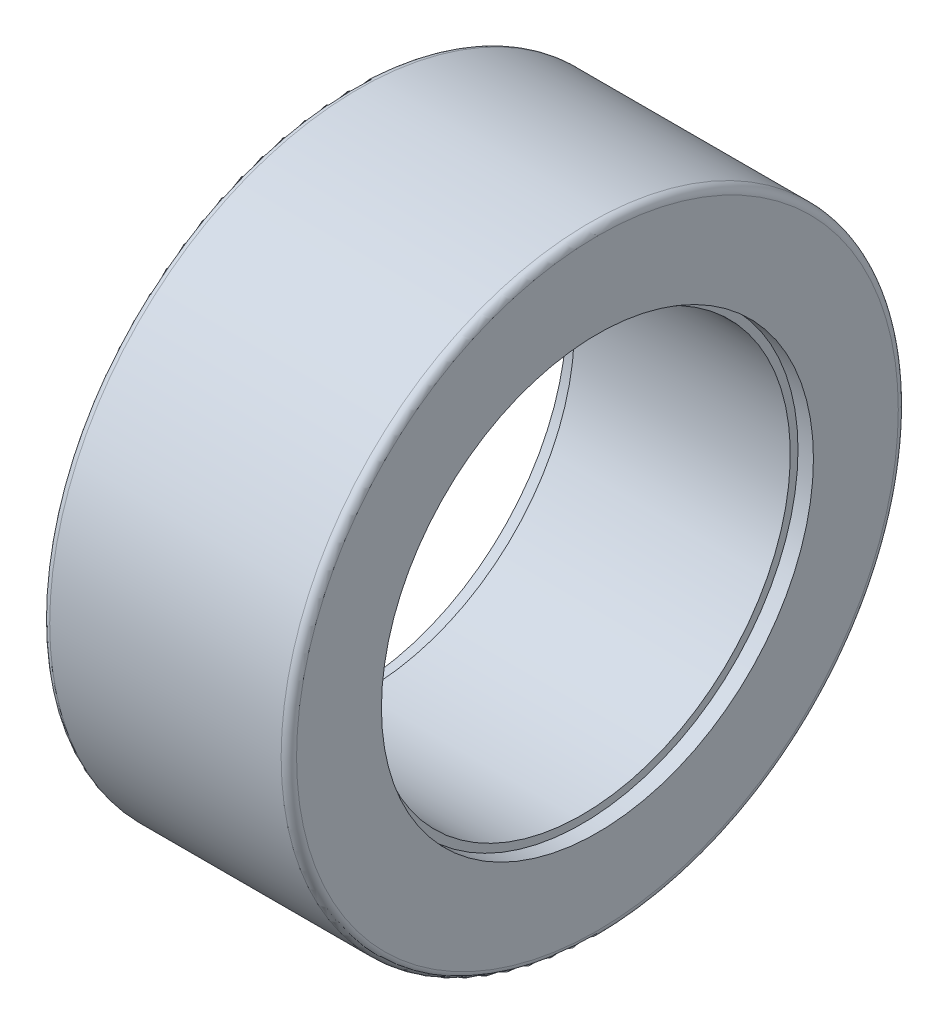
ISO-10303-21;
HEADER;
FILE_DESCRIPTION(('STEP AP214'),'2;1');
FILE_NAME('part.step','',(''),(''),'','','');
FILE_SCHEMA(('AUTOMOTIVE_DESIGN { 1 0 10303 214 1 1 1 1 }'));
ENDSEC;
DATA;
#1=APPLICATION_CONTEXT('core data for automotive mechanical design processes');
#2=APPLICATION_PROTOCOL_DEFINITION('international standard','automotive_design',2000,#1);
#3=PRODUCT_CONTEXT('',#1,'mechanical');
#4=PRODUCT('Part','Part','',(#3));
#5=PRODUCT_RELATED_PRODUCT_CATEGORY('part','',(#4));
#6=PRODUCT_DEFINITION_FORMATION('','',#4);
#7=PRODUCT_DEFINITION_CONTEXT('part definition',#1,'design');
#8=PRODUCT_DEFINITION('design','',#6,#7);
#9=PRODUCT_DEFINITION_SHAPE('','',#8);
#10=(LENGTH_UNIT() NAMED_UNIT(*) SI_UNIT(.MILLI.,.METRE.));
#11=(NAMED_UNIT(*) PLANE_ANGLE_UNIT() SI_UNIT($,.RADIAN.));
#12=(NAMED_UNIT(*) SI_UNIT($,.STERADIAN.) SOLID_ANGLE_UNIT());
#13=UNCERTAINTY_MEASURE_WITH_UNIT(LENGTH_MEASURE(1.E-05),#10,'distance_accuracy_value','');
#14=(GEOMETRIC_REPRESENTATION_CONTEXT(3) GLOBAL_UNCERTAINTY_ASSIGNED_CONTEXT((#13)) GLOBAL_UNIT_ASSIGNED_CONTEXT((#10,
#11,#12)) REPRESENTATION_CONTEXT('',''));
#15=CARTESIAN_POINT('',(0.,0.,0.));
#16=DIRECTION('',(0.,0.,1.));
#17=DIRECTION('',(1.,0.,0.));
#18=AXIS2_PLACEMENT_3D('',#15,#16,#17);
#19=CARTESIAN_POINT('',(-15.,0.,0.));
#20=DIRECTION('',(-1.,0.,0.));
#21=DIRECTION('',(0.,0.,1.));
#22=AXIS2_PLACEMENT_3D('',#19,#20,#21);
#23=TOROIDAL_SURFACE('',#22,39.,1.);
#24=CARTESIAN_POINT('',(-16.,0.,0.));
#25=DIRECTION('',(-1.,0.,0.));
#26=DIRECTION('',(0.,0.,1.));
#27=AXIS2_PLACEMENT_3D('',#24,#25,#26);
#28=CIRCLE('',#27,39.);
#29=CARTESIAN_POINT('',(-16.,0.,39.));
#30=VERTEX_POINT('',#29);
#31=EDGE_CURVE('E10',#30,#30,#28,.T.);
#32=ORIENTED_EDGE('',*,*,#31,.F.);
#33=EDGE_LOOP('',(#32));
#34=FACE_BOUND('',#33,.T.);
#35=CARTESIAN_POINT('',(-15.,0.,0.));
#36=DIRECTION('',(-1.,0.,0.));
#37=DIRECTION('',(0.,0.,1.));
#38=AXIS2_PLACEMENT_3D('',#35,#36,#37);
#39=CIRCLE('',#38,40.);
#40=CARTESIAN_POINT('',(-15.,0.,40.));
#41=VERTEX_POINT('',#40);
#42=EDGE_CURVE('E71',#41,#41,#39,.T.);
#43=ORIENTED_EDGE('',*,*,#42,.T.);
#44=EDGE_LOOP('',(#43));
#45=FACE_BOUND('',#44,.T.);
#46=ADVANCED_FACE('F37',(#34,#45),#23,.T.);
#47=CARTESIAN_POINT('',(-16.,28.,0.));
#48=DIRECTION('',(1.,0.,0.));
#49=DIRECTION('',(0.,0.,-1.));
#50=AXIS2_PLACEMENT_3D('',#47,#48,#49);
#51=PLANE('',#50);
#52=CARTESIAN_POINT('',(-16.,0.,0.));
#53=DIRECTION('',(-1.,0.,0.));
#54=DIRECTION('',(0.,0.,1.));
#55=AXIS2_PLACEMENT_3D('',#52,#53,#54);
#56=CIRCLE('',#55,28.);
#57=CARTESIAN_POINT('',(-16.,0.,28.));
#58=VERTEX_POINT('',#57);
#59=EDGE_CURVE('E43',#58,#58,#56,.T.);
#60=ORIENTED_EDGE('',*,*,#59,.F.);
#61=EDGE_LOOP('',(#60));
#62=FACE_BOUND('',#61,.T.);
#63=ORIENTED_EDGE('',*,*,#31,.T.);
#64=EDGE_LOOP('',(#63));
#65=FACE_BOUND('',#64,.T.);
#66=ADVANCED_FACE('F120',(#62,#65),#51,.F.);
#67=CARTESIAN_POINT('',(-79.557359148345,0.,0.));
#68=DIRECTION('',(-1.,0.,0.));
#69=DIRECTION('',(0.,0.,1.));
#70=AXIS2_PLACEMENT_3D('',#67,#68,#69);
#71=CYLINDRICAL_SURFACE('',#70,28.);
#72=CARTESIAN_POINT('',(-14.,0.,0.));
#73=DIRECTION('',(-1.,0.,0.));
#74=DIRECTION('',(0.,0.,1.));
#75=AXIS2_PLACEMENT_3D('',#72,#73,#74);
#76=CIRCLE('',#75,28.);
#77=CARTESIAN_POINT('',(-14.,0.,28.));
#78=VERTEX_POINT('',#77);
#79=EDGE_CURVE('E47',#78,#78,#76,.T.);
#80=ORIENTED_EDGE('',*,*,#79,.F.);
#81=EDGE_LOOP('',(#80));
#82=FACE_BOUND('',#81,.T.);
#83=ORIENTED_EDGE('',*,*,#59,.T.);
#84=EDGE_LOOP('',(#83));
#85=FACE_BOUND('',#84,.T.);
#86=ADVANCED_FACE('F115',(#82,#85),#71,.F.);
#87=CARTESIAN_POINT('',(-14.,27.,0.));
#88=DIRECTION('',(1.,0.,0.));
#89=DIRECTION('',(0.,0.,-1.));
#90=AXIS2_PLACEMENT_3D('',#87,#88,#89);
#91=PLANE('',#90);
#92=CARTESIAN_POINT('',(-14.,0.,0.));
#93=DIRECTION('',(-1.,0.,0.));
#94=DIRECTION('',(0.,0.,1.));
#95=AXIS2_PLACEMENT_3D('',#92,#93,#94);
#96=CIRCLE('',#95,27.);
#97=CARTESIAN_POINT('',(-14.,0.,27.));
#98=VERTEX_POINT('',#97);
#99=EDGE_CURVE('E51',#98,#98,#96,.T.);
#100=ORIENTED_EDGE('',*,*,#99,.F.);
#101=EDGE_LOOP('',(#100));
#102=FACE_BOUND('',#101,.T.);
#103=ORIENTED_EDGE('',*,*,#79,.T.);
#104=EDGE_LOOP('',(#103));
#105=FACE_BOUND('',#104,.T.);
#106=ADVANCED_FACE('F109',(#102,#105),#91,.F.);
#107=CARTESIAN_POINT('',(-79.557359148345,0.,0.));
#108=DIRECTION('',(-1.,0.,0.));
#109=DIRECTION('',(0.,0.,1.));
#110=AXIS2_PLACEMENT_3D('',#107,#108,#109);
#111=CYLINDRICAL_SURFACE('',#110,27.);
#112=CARTESIAN_POINT('',(14.,0.,0.));
#113=DIRECTION('',(-1.,0.,0.));
#114=DIRECTION('',(0.,0.,1.));
#115=AXIS2_PLACEMENT_3D('',#112,#113,#114);
#116=CIRCLE('',#115,27.);
#117=CARTESIAN_POINT('',(14.,0.,27.));
#118=VERTEX_POINT('',#117);
#119=EDGE_CURVE('E56',#118,#118,#116,.T.);
#120=ORIENTED_EDGE('',*,*,#119,.F.);
#121=EDGE_LOOP('',(#120));
#122=FACE_BOUND('',#121,.T.);
#123=ORIENTED_EDGE('',*,*,#99,.T.);
#124=EDGE_LOOP('',(#123));
#125=FACE_BOUND('',#124,.T.);
#126=ADVANCED_FACE('F103',(#122,#125),#111,.F.);
#127=CARTESIAN_POINT('',(14.,28.,0.));
#128=DIRECTION('',(-1.,0.,0.));
#129=DIRECTION('',(0.,0.,1.));
#130=AXIS2_PLACEMENT_3D('',#127,#128,#129);
#131=PLANE('',#130);
#132=CARTESIAN_POINT('',(14.,0.,0.));
#133=DIRECTION('',(-1.,0.,0.));
#134=DIRECTION('',(0.,0.,1.));
#135=AXIS2_PLACEMENT_3D('',#132,#133,#134);
#136=CIRCLE('',#135,28.);
#137=CARTESIAN_POINT('',(14.,0.,28.));
#138=VERTEX_POINT('',#137);
#139=EDGE_CURVE('E59',#138,#138,#136,.T.);
#140=ORIENTED_EDGE('',*,*,#139,.F.);
#141=EDGE_LOOP('',(#140));
#142=FACE_BOUND('',#141,.T.);
#143=ORIENTED_EDGE('',*,*,#119,.T.);
#144=EDGE_LOOP('',(#143));
#145=FACE_BOUND('',#144,.T.);
#146=ADVANCED_FACE('F97',(#142,#145),#131,.F.);
#147=CARTESIAN_POINT('',(-79.557359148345,0.,0.));
#148=DIRECTION('',(-1.,0.,0.));
#149=DIRECTION('',(0.,0.,1.));
#150=AXIS2_PLACEMENT_3D('',#147,#148,#149);
#151=CYLINDRICAL_SURFACE('',#150,28.);
#152=CARTESIAN_POINT('',(16.,0.,0.));
#153=DIRECTION('',(-1.,0.,0.));
#154=DIRECTION('',(0.,0.,1.));
#155=AXIS2_PLACEMENT_3D('',#152,#153,#154);
#156=CIRCLE('',#155,28.);
#157=CARTESIAN_POINT('',(16.,0.,28.));
#158=VERTEX_POINT('',#157);
#159=EDGE_CURVE('E62',#158,#158,#156,.T.);
#160=ORIENTED_EDGE('',*,*,#159,.F.);
#161=EDGE_LOOP('',(#160));
#162=FACE_BOUND('',#161,.T.);
#163=ORIENTED_EDGE('',*,*,#139,.T.);
#164=EDGE_LOOP('',(#163));
#165=FACE_BOUND('',#164,.T.);
#166=ADVANCED_FACE('F91',(#162,#165),#151,.F.);
#167=CARTESIAN_POINT('',(16.,39.,0.));
#168=DIRECTION('',(-1.,0.,0.));
#169=DIRECTION('',(0.,0.,1.));
#170=AXIS2_PLACEMENT_3D('',#167,#168,#169);
#171=PLANE('',#170);
#172=CARTESIAN_POINT('',(16.,0.,0.));
#173=DIRECTION('',(-1.,0.,0.));
#174=DIRECTION('',(0.,0.,1.));
#175=AXIS2_PLACEMENT_3D('',#172,#173,#174);
#176=CIRCLE('',#175,39.);
#177=CARTESIAN_POINT('',(16.,0.,39.));
#178=VERTEX_POINT('',#177);
#179=EDGE_CURVE('E65',#178,#178,#176,.T.);
#180=ORIENTED_EDGE('',*,*,#179,.F.);
#181=EDGE_LOOP('',(#180));
#182=FACE_BOUND('',#181,.T.);
#183=ORIENTED_EDGE('',*,*,#159,.T.);
#184=EDGE_LOOP('',(#183));
#185=FACE_BOUND('',#184,.T.);
#186=ADVANCED_FACE('F85',(#182,#185),#171,.F.);
#187=CARTESIAN_POINT('',(15.,0.,0.));
#188=DIRECTION('',(-1.,0.,0.));
#189=DIRECTION('',(0.,0.,1.));
#190=AXIS2_PLACEMENT_3D('',#187,#188,#189);
#191=TOROIDAL_SURFACE('',#190,39.,1.);
#192=CARTESIAN_POINT('',(15.,0.,0.));
#193=DIRECTION('',(-1.,0.,0.));
#194=DIRECTION('',(0.,0.,1.));
#195=AXIS2_PLACEMENT_3D('',#192,#193,#194);
#196=CIRCLE('',#195,40.);
#197=CARTESIAN_POINT('',(15.,0.,40.));
#198=VERTEX_POINT('',#197);
#199=EDGE_CURVE('E68',#198,#198,#196,.T.);
#200=ORIENTED_EDGE('',*,*,#199,.F.);
#201=EDGE_LOOP('',(#200));
#202=FACE_BOUND('',#201,.T.);
#203=ORIENTED_EDGE('',*,*,#179,.T.);
#204=EDGE_LOOP('',(#203));
#205=FACE_BOUND('',#204,.T.);
#206=ADVANCED_FACE('F79',(#202,#205),#191,.T.);
#207=CARTESIAN_POINT('',(-79.557359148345,0.,0.));
#208=DIRECTION('',(-1.,0.,0.));
#209=DIRECTION('',(0.,0.,1.));
#210=AXIS2_PLACEMENT_3D('',#207,#208,#209);
#211=CYLINDRICAL_SURFACE('',#210,40.);
#212=ORIENTED_EDGE('',*,*,#42,.F.);
#213=EDGE_LOOP('',(#212));
#214=FACE_BOUND('',#213,.T.);
#215=ORIENTED_EDGE('',*,*,#199,.T.);
#216=EDGE_LOOP('',(#215));
#217=FACE_BOUND('',#216,.T.);
#218=ADVANCED_FACE('F76',(#214,#217),#211,.T.);
#219=CLOSED_SHELL('',(#46,#66,#86,#106,#126,#146,#166,#186,#206,#218));
#220=MANIFOLD_SOLID_BREP('B2',#219);
#221=ADVANCED_BREP_SHAPE_REPRESENTATION('',(#18,#220),#14);
#222=SHAPE_DEFINITION_REPRESENTATION(#9,#221);
ENDSEC;
END-ISO-10303-21;
